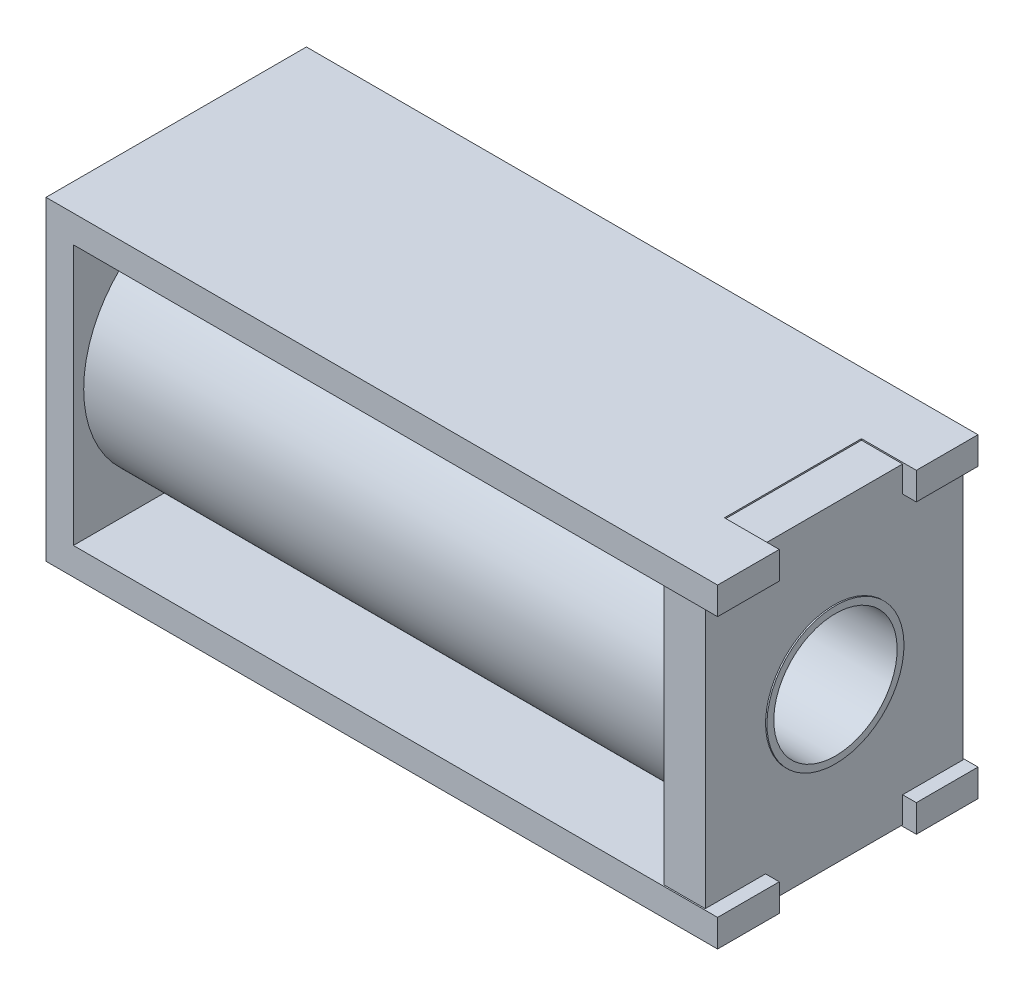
ISO-10303-21;
HEADER;
FILE_DESCRIPTION(('STEP AP214'),'2;1');
FILE_NAME('part.step','',(''),(''),'','','');
FILE_SCHEMA(('AUTOMOTIVE_DESIGN { 1 0 10303 214 1 1 1 1 }'));
ENDSEC;
DATA;
#1=APPLICATION_CONTEXT('core data for automotive mechanical design processes');
#2=APPLICATION_PROTOCOL_DEFINITION('international standard','automotive_design',2000,#1);
#3=PRODUCT_CONTEXT('',#1,'mechanical');
#4=PRODUCT('Part','Part','',(#3));
#5=PRODUCT_RELATED_PRODUCT_CATEGORY('part','',(#4));
#6=PRODUCT_DEFINITION_FORMATION('','',#4);
#7=PRODUCT_DEFINITION_CONTEXT('part definition',#1,'design');
#8=PRODUCT_DEFINITION('design','',#6,#7);
#9=PRODUCT_DEFINITION_SHAPE('','',#8);
#10=(LENGTH_UNIT() NAMED_UNIT(*) SI_UNIT(.MILLI.,.METRE.));
#11=(NAMED_UNIT(*) PLANE_ANGLE_UNIT() SI_UNIT($,.RADIAN.));
#12=(NAMED_UNIT(*) SI_UNIT($,.STERADIAN.) SOLID_ANGLE_UNIT());
#13=UNCERTAINTY_MEASURE_WITH_UNIT(LENGTH_MEASURE(1.E-05),#10,'distance_accuracy_value','');
#14=(GEOMETRIC_REPRESENTATION_CONTEXT(3) GLOBAL_UNCERTAINTY_ASSIGNED_CONTEXT((#13)) GLOBAL_UNIT_ASSIGNED_CONTEXT((#10,
#11,#12)) REPRESENTATION_CONTEXT('',''));
#15=CARTESIAN_POINT('',(0.,0.,0.));
#16=DIRECTION('',(0.,0.,1.));
#17=DIRECTION('',(1.,0.,0.));
#18=AXIS2_PLACEMENT_3D('',#15,#16,#17);
#19=CARTESIAN_POINT('',(49.,9.50000000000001,-9.5));
#20=DIRECTION('',(0.,-1.,0.));
#21=DIRECTION('',(1.,0.,0.));
#22=AXIS2_PLACEMENT_3D('',#19,#20,#21);
#23=PLANE('',#22);
#24=DIRECTION('',(-1.,0.,0.));
#25=VECTOR('',#24,1.);
#26=CARTESIAN_POINT('',(48.,9.5,9.4));
#27=LINE('',#26,#25);
#28=CARTESIAN_POINT('',(48.,9.5,9.4));
#29=VERTEX_POINT('',#28);
#30=CARTESIAN_POINT('',(45.,9.5,9.4));
#31=VERTEX_POINT('',#30);
#32=EDGE_CURVE('E205',#29,#31,#27,.T.);
#33=ORIENTED_EDGE('',*,*,#32,.F.);
#34=DIRECTION('',(0.,0.,1.));
#35=VECTOR('',#34,1.);
#36=CARTESIAN_POINT('',(48.,9.5,9.4));
#37=LINE('',#36,#35);
#38=CARTESIAN_POINT('',(48.,9.50000000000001,5.));
#39=VERTEX_POINT('',#38);
#40=EDGE_CURVE('E210',#39,#29,#37,.T.);
#41=ORIENTED_EDGE('',*,*,#40,.F.);
#42=DIRECTION('',(1.,0.,0.));
#43=VECTOR('',#42,1.);
#44=CARTESIAN_POINT('',(45.,9.5,5.));
#45=LINE('',#44,#43);
#46=CARTESIAN_POINT('',(49.,9.5,5.));
#47=VERTEX_POINT('',#46);
#48=EDGE_CURVE('E268',#39,#47,#45,.T.);
#49=ORIENTED_EDGE('',*,*,#48,.T.);
#50=DIRECTION('',(0.,0.,1.));
#51=VECTOR('',#50,1.);
#52=CARTESIAN_POINT('',(49.,9.50000000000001,-9.5));
#53=LINE('',#52,#51);
#54=CARTESIAN_POINT('',(49.,9.50000000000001,9.5));
#55=VERTEX_POINT('',#54);
#56=EDGE_CURVE('E327',#47,#55,#53,.T.);
#57=ORIENTED_EDGE('',*,*,#56,.T.);
#58=DIRECTION('',(1.,0.,0.));
#59=VECTOR('',#58,1.);
#60=CARTESIAN_POINT('',(49.,9.50000000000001,9.5));
#61=LINE('',#60,#59);
#62=CARTESIAN_POINT('',(2.,9.5,9.5));
#63=VERTEX_POINT('',#62);
#64=EDGE_CURVE('E294',#63,#55,#61,.T.);
#65=ORIENTED_EDGE('',*,*,#64,.F.);
#66=DIRECTION('',(0.,0.,1.));
#67=VECTOR('',#66,1.);
#68=CARTESIAN_POINT('',(2.,9.5,-9.5));
#69=LINE('',#68,#67);
#70=CARTESIAN_POINT('',(2.,9.5,-9.5));
#71=VERTEX_POINT('',#70);
#72=EDGE_CURVE('E328',#71,#63,#69,.T.);
#73=ORIENTED_EDGE('',*,*,#72,.F.);
#74=DIRECTION('',(1.,0.,0.));
#75=VECTOR('',#74,1.);
#76=CARTESIAN_POINT('',(49.,9.50000000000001,-9.5));
#77=LINE('',#76,#75);
#78=CARTESIAN_POINT('',(49.,9.50000000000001,-9.5));
#79=VERTEX_POINT('',#78);
#80=EDGE_CURVE('E318',#71,#79,#77,.T.);
#81=ORIENTED_EDGE('',*,*,#80,.T.);
#82=CARTESIAN_POINT('',(49.,9.5,-5.));
#83=VERTEX_POINT('',#82);
#84=EDGE_CURVE('E324',#79,#83,#53,.T.);
#85=ORIENTED_EDGE('',*,*,#84,.T.);
#86=DIRECTION('',(1.,0.,0.));
#87=VECTOR('',#86,1.);
#88=CARTESIAN_POINT('',(45.,9.5,-5.));
#89=LINE('',#88,#87);
#90=CARTESIAN_POINT('',(48.,9.5,-5.));
#91=VERTEX_POINT('',#90);
#92=EDGE_CURVE('E265',#91,#83,#89,.T.);
#93=ORIENTED_EDGE('',*,*,#92,.F.);
#94=DIRECTION('',(0.,0.,1.));
#95=VECTOR('',#94,1.);
#96=CARTESIAN_POINT('',(48.,9.5,-5.));
#97=LINE('',#96,#95);
#98=CARTESIAN_POINT('',(48.,9.5,-9.4));
#99=VERTEX_POINT('',#98);
#100=EDGE_CURVE('E446',#99,#91,#97,.T.);
#101=ORIENTED_EDGE('',*,*,#100,.F.);
#102=DIRECTION('',(-1.,0.,0.));
#103=VECTOR('',#102,1.);
#104=CARTESIAN_POINT('',(48.,9.5,-9.4));
#105=LINE('',#104,#103);
#106=CARTESIAN_POINT('',(45.,9.5,-9.4));
#107=VERTEX_POINT('',#106);
#108=EDGE_CURVE('E417',#99,#107,#105,.T.);
#109=ORIENTED_EDGE('',*,*,#108,.T.);
#110=DIRECTION('',(0.,0.,-1.));
#111=VECTOR('',#110,1.);
#112=CARTESIAN_POINT('',(45.,9.5,5.));
#113=LINE('',#112,#111);
#114=EDGE_CURVE('E221',#31,#107,#113,.T.);
#115=ORIENTED_EDGE('',*,*,#114,.F.);
#116=EDGE_LOOP('',(#33,#41,#49,#57,#65,#73,#81,#85,#93,#101,#109,#115));
#117=FACE_BOUND('',#116,.T.);
#118=ADVANCED_FACE('F38',(#117),#23,.T.);
#119=CARTESIAN_POINT('',(49.,-9.50000000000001,-9.5));
#120=DIRECTION('',(0.,1.,0.));
#121=DIRECTION('',(-1.,0.,0.));
#122=AXIS2_PLACEMENT_3D('',#119,#120,#121);
#123=PLANE('',#122);
#124=DIRECTION('',(-1.,0.,0.));
#125=VECTOR('',#124,1.);
#126=CARTESIAN_POINT('',(48.,-9.5,-9.4));
#127=LINE('',#126,#125);
#128=CARTESIAN_POINT('',(48.,-9.50000000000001,-9.4));
#129=VERTEX_POINT('',#128);
#130=CARTESIAN_POINT('',(45.,-9.50000000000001,-9.4));
#131=VERTEX_POINT('',#130);
#132=EDGE_CURVE('E55',#129,#131,#127,.T.);
#133=ORIENTED_EDGE('',*,*,#132,.F.);
#134=DIRECTION('',(0.,0.,-1.));
#135=VECTOR('',#134,1.);
#136=CARTESIAN_POINT('',(48.,-9.5,-5.));
#137=LINE('',#136,#135);
#138=CARTESIAN_POINT('',(48.,-9.5,-5.));
#139=VERTEX_POINT('',#138);
#140=EDGE_CURVE('E442',#139,#129,#137,.T.);
#141=ORIENTED_EDGE('',*,*,#140,.F.);
#142=DIRECTION('',(1.,0.,0.));
#143=VECTOR('',#142,1.);
#144=CARTESIAN_POINT('',(45.,-9.5,-5.));
#145=LINE('',#144,#143);
#146=CARTESIAN_POINT('',(49.,-9.5,-5.));
#147=VERTEX_POINT('',#146);
#148=EDGE_CURVE('E245',#139,#147,#145,.T.);
#149=ORIENTED_EDGE('',*,*,#148,.T.);
#150=DIRECTION('',(0.,0.,1.));
#151=VECTOR('',#150,1.);
#152=CARTESIAN_POINT('',(49.,-9.50000000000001,-9.5));
#153=LINE('',#152,#151);
#154=CARTESIAN_POINT('',(49.,-9.50000000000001,-9.5));
#155=VERTEX_POINT('',#154);
#156=EDGE_CURVE('E332',#155,#147,#153,.T.);
#157=ORIENTED_EDGE('',*,*,#156,.F.);
#158=DIRECTION('',(-1.,0.,0.));
#159=VECTOR('',#158,1.);
#160=CARTESIAN_POINT('',(49.,-9.50000000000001,-9.5));
#161=LINE('',#160,#159);
#162=CARTESIAN_POINT('',(2.,-9.5,-9.5));
#163=VERTEX_POINT('',#162);
#164=EDGE_CURVE('E312',#155,#163,#161,.T.);
#165=ORIENTED_EDGE('',*,*,#164,.T.);
#166=DIRECTION('',(0.,0.,1.));
#167=VECTOR('',#166,1.);
#168=CARTESIAN_POINT('',(2.,-9.5,-9.5));
#169=LINE('',#168,#167);
#170=CARTESIAN_POINT('',(2.,-9.5,9.5));
#171=VERTEX_POINT('',#170);
#172=EDGE_CURVE('E330',#163,#171,#169,.T.);
#173=ORIENTED_EDGE('',*,*,#172,.T.);
#174=DIRECTION('',(-1.,0.,0.));
#175=VECTOR('',#174,1.);
#176=CARTESIAN_POINT('',(49.,-9.50000000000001,9.5));
#177=LINE('',#176,#175);
#178=CARTESIAN_POINT('',(49.,-9.50000000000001,9.5));
#179=VERTEX_POINT('',#178);
#180=EDGE_CURVE('E288',#179,#171,#177,.T.);
#181=ORIENTED_EDGE('',*,*,#180,.F.);
#182=CARTESIAN_POINT('',(49.,-9.5,5.));
#183=VERTEX_POINT('',#182);
#184=EDGE_CURVE('E335',#183,#179,#153,.T.);
#185=ORIENTED_EDGE('',*,*,#184,.F.);
#186=DIRECTION('',(1.,0.,0.));
#187=VECTOR('',#186,1.);
#188=CARTESIAN_POINT('',(45.,-9.5,5.));
#189=LINE('',#188,#187);
#190=CARTESIAN_POINT('',(48.,-9.5,5.));
#191=VERTEX_POINT('',#190);
#192=EDGE_CURVE('E242',#191,#183,#189,.T.);
#193=ORIENTED_EDGE('',*,*,#192,.F.);
#194=DIRECTION('',(0.,0.,-1.));
#195=VECTOR('',#194,1.);
#196=CARTESIAN_POINT('',(48.,-9.5,9.4));
#197=LINE('',#196,#195);
#198=CARTESIAN_POINT('',(48.,-9.50000000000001,9.4));
#199=VERTEX_POINT('',#198);
#200=EDGE_CURVE('E209',#199,#191,#197,.T.);
#201=ORIENTED_EDGE('',*,*,#200,.F.);
#202=DIRECTION('',(-1.,0.,0.));
#203=VECTOR('',#202,1.);
#204=CARTESIAN_POINT('',(48.,-9.5,9.4));
#205=LINE('',#204,#203);
#206=CARTESIAN_POINT('',(45.,-9.50000000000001,9.4));
#207=VERTEX_POINT('',#206);
#208=EDGE_CURVE('E206',#199,#207,#205,.T.);
#209=ORIENTED_EDGE('',*,*,#208,.T.);
#210=DIRECTION('',(0.,0.,1.));
#211=VECTOR('',#210,1.);
#212=CARTESIAN_POINT('',(45.,-9.5,5.));
#213=LINE('',#212,#211);
#214=EDGE_CURVE('E60',#131,#207,#213,.T.);
#215=ORIENTED_EDGE('',*,*,#214,.F.);
#216=EDGE_LOOP('',(#133,#141,#149,#157,#165,#173,#181,#185,#193,#201,#209,#215));
#217=FACE_BOUND('',#216,.T.);
#218=ADVANCED_FACE('F394',(#217),#123,.T.);
#219=CARTESIAN_POINT('',(45.,11.5,-5.));
#220=DIRECTION('',(0.,0.,-1.));
#221=DIRECTION('',(-1.,0.,0.));
#222=AXIS2_PLACEMENT_3D('',#219,#220,#221);
#223=PLANE('',#222);
#224=DIRECTION('',(-1.,0.,0.));
#225=VECTOR('',#224,1.);
#226=CARTESIAN_POINT('',(48.,11.4,-5.));
#227=LINE('',#226,#225);
#228=CARTESIAN_POINT('',(48.,11.4,-5.));
#229=VERTEX_POINT('',#228);
#230=CARTESIAN_POINT('',(45.,11.4,-5.));
#231=VERTEX_POINT('',#230);
#232=EDGE_CURVE('E400',#229,#231,#227,.T.);
#233=ORIENTED_EDGE('',*,*,#232,.F.);
#234=DIRECTION('',(0.,1.,0.));
#235=VECTOR('',#234,1.);
#236=CARTESIAN_POINT('',(48.,9.5,-5.));
#237=LINE('',#236,#235);
#238=EDGE_CURVE('E402',#91,#229,#237,.T.);
#239=ORIENTED_EDGE('',*,*,#238,.F.);
#240=ORIENTED_EDGE('',*,*,#92,.T.);
#241=DIRECTION('',(0.,1.,0.));
#242=VECTOR('',#241,1.);
#243=CARTESIAN_POINT('',(49.,11.5,-5.));
#244=LINE('',#243,#242);
#245=CARTESIAN_POINT('',(49.,11.5,-5.));
#246=VERTEX_POINT('',#245);
#247=EDGE_CURVE('E244',#83,#246,#244,.T.);
#248=ORIENTED_EDGE('',*,*,#247,.T.);
#249=DIRECTION('',(1.,0.,0.));
#250=VECTOR('',#249,1.);
#251=CARTESIAN_POINT('',(45.,11.5,-5.));
#252=LINE('',#251,#250);
#253=CARTESIAN_POINT('',(45.,11.5,-5.));
#254=VERTEX_POINT('',#253);
#255=EDGE_CURVE('E261',#254,#246,#252,.T.);
#256=ORIENTED_EDGE('',*,*,#255,.F.);
#257=DIRECTION('',(0.,1.,0.));
#258=VECTOR('',#257,1.);
#259=CARTESIAN_POINT('',(45.,11.5,-5.));
#260=LINE('',#259,#258);
#261=EDGE_CURVE('E251',#231,#254,#260,.T.);
#262=ORIENTED_EDGE('',*,*,#261,.F.);
#263=EDGE_LOOP('',(#233,#239,#240,#248,#256,#262));
#264=FACE_BOUND('',#263,.T.);
#265=ADVANCED_FACE('F371',(#264),#223,.F.);
#266=CARTESIAN_POINT('',(45.,11.5,5.));
#267=DIRECTION('',(0.,0.,1.));
#268=DIRECTION('',(1.,0.,0.));
#269=AXIS2_PLACEMENT_3D('',#266,#267,#268);
#270=PLANE('',#269);
#271=DIRECTION('',(-1.,0.,0.));
#272=VECTOR('',#271,1.);
#273=CARTESIAN_POINT('',(48.,11.4,5.));
#274=LINE('',#273,#272);
#275=CARTESIAN_POINT('',(48.,11.4,5.));
#276=VERTEX_POINT('',#275);
#277=CARTESIAN_POINT('',(45.,11.4,5.));
#278=VERTEX_POINT('',#277);
#279=EDGE_CURVE('E363',#276,#278,#274,.T.);
#280=ORIENTED_EDGE('',*,*,#279,.T.);
#281=DIRECTION('',(0.,-1.,0.));
#282=VECTOR('',#281,1.);
#283=CARTESIAN_POINT('',(45.,11.5,5.));
#284=LINE('',#283,#282);
#285=CARTESIAN_POINT('',(45.,11.5,5.));
#286=VERTEX_POINT('',#285);
#287=EDGE_CURVE('E257',#286,#278,#284,.T.);
#288=ORIENTED_EDGE('',*,*,#287,.F.);
#289=DIRECTION('',(1.,0.,0.));
#290=VECTOR('',#289,1.);
#291=CARTESIAN_POINT('',(45.,11.5,5.));
#292=LINE('',#291,#290);
#293=CARTESIAN_POINT('',(49.,11.5,5.));
#294=VERTEX_POINT('',#293);
#295=EDGE_CURVE('E270',#286,#294,#292,.T.);
#296=ORIENTED_EDGE('',*,*,#295,.T.);
#297=DIRECTION('',(0.,-1.,0.));
#298=VECTOR('',#297,1.);
#299=CARTESIAN_POINT('',(49.,11.5,5.));
#300=LINE('',#299,#298);
#301=EDGE_CURVE('E254',#294,#47,#300,.T.);
#302=ORIENTED_EDGE('',*,*,#301,.T.);
#303=ORIENTED_EDGE('',*,*,#48,.F.);
#304=DIRECTION('',(0.,-1.,0.));
#305=VECTOR('',#304,1.);
#306=CARTESIAN_POINT('',(48.,11.4,5.));
#307=LINE('',#306,#305);
#308=EDGE_CURVE('E215',#276,#39,#307,.T.);
#309=ORIENTED_EDGE('',*,*,#308,.F.);
#310=EDGE_LOOP('',(#280,#288,#296,#302,#303,#309));
#311=FACE_BOUND('',#310,.T.);
#312=ADVANCED_FACE('F361',(#311),#270,.F.);
#313=CARTESIAN_POINT('',(45.,0.,0.));
#314=DIRECTION('',(1.,0.,0.));
#315=DIRECTION('',(0.,0.,-1.));
#316=AXIS2_PLACEMENT_3D('',#313,#314,#315);
#317=PLANE('',#316);
#318=ORIENTED_EDGE('',*,*,#287,.T.);
#319=DIRECTION('',(0.,0.,1.));
#320=VECTOR('',#319,1.);
#321=CARTESIAN_POINT('',(45.,11.4,-5.));
#322=LINE('',#321,#320);
#323=EDGE_CURVE('E218',#231,#278,#322,.T.);
#324=ORIENTED_EDGE('',*,*,#323,.F.);
#325=ORIENTED_EDGE('',*,*,#261,.T.);
#326=DIRECTION('',(0.,0.,1.));
#327=VECTOR('',#326,1.);
#328=CARTESIAN_POINT('',(45.,11.5,5.));
#329=LINE('',#328,#327);
#330=EDGE_CURVE('E253',#254,#286,#329,.T.);
#331=ORIENTED_EDGE('',*,*,#330,.T.);
#332=EDGE_LOOP('',(#318,#324,#325,#331));
#333=FACE_BOUND('',#332,.T.);
#334=ADVANCED_FACE('F366',(#333),#317,.T.);
#335=CARTESIAN_POINT('',(45.,-11.5,5.));
#336=DIRECTION('',(0.,0.,1.));
#337=DIRECTION('',(1.,0.,0.));
#338=AXIS2_PLACEMENT_3D('',#335,#336,#337);
#339=PLANE('',#338);
#340=DIRECTION('',(-1.,0.,0.));
#341=VECTOR('',#340,1.);
#342=CARTESIAN_POINT('',(48.,-11.4,5.));
#343=LINE('',#342,#341);
#344=CARTESIAN_POINT('',(48.,-11.4,5.));
#345=VERTEX_POINT('',#344);
#346=CARTESIAN_POINT('',(45.,-11.4,5.));
#347=VERTEX_POINT('',#346);
#348=EDGE_CURVE('E227',#345,#347,#343,.T.);
#349=ORIENTED_EDGE('',*,*,#348,.F.);
#350=DIRECTION('',(0.,-1.,0.));
#351=VECTOR('',#350,1.);
#352=CARTESIAN_POINT('',(48.,-9.5,5.));
#353=LINE('',#352,#351);
#354=EDGE_CURVE('E433',#191,#345,#353,.T.);
#355=ORIENTED_EDGE('',*,*,#354,.F.);
#356=ORIENTED_EDGE('',*,*,#192,.T.);
#357=DIRECTION('',(0.,-1.,0.));
#358=VECTOR('',#357,1.);
#359=CARTESIAN_POINT('',(49.,-11.5,5.));
#360=LINE('',#359,#358);
#361=CARTESIAN_POINT('',(49.,-11.5,5.));
#362=VERTEX_POINT('',#361);
#363=EDGE_CURVE('E223',#183,#362,#360,.T.);
#364=ORIENTED_EDGE('',*,*,#363,.T.);
#365=DIRECTION('',(1.,0.,0.));
#366=VECTOR('',#365,1.);
#367=CARTESIAN_POINT('',(45.,-11.5,5.));
#368=LINE('',#367,#366);
#369=CARTESIAN_POINT('',(45.,-11.5,5.));
#370=VERTEX_POINT('',#369);
#371=EDGE_CURVE('E238',#370,#362,#368,.T.);
#372=ORIENTED_EDGE('',*,*,#371,.F.);
#373=DIRECTION('',(0.,-1.,0.));
#374=VECTOR('',#373,1.);
#375=CARTESIAN_POINT('',(45.,-11.5,5.));
#376=LINE('',#375,#374);
#377=EDGE_CURVE('E231',#347,#370,#376,.T.);
#378=ORIENTED_EDGE('',*,*,#377,.F.);
#379=EDGE_LOOP('',(#349,#355,#356,#364,#372,#378));
#380=FACE_BOUND('',#379,.T.);
#381=ADVANCED_FACE('F432',(#380),#339,.F.);
#382=CARTESIAN_POINT('',(45.,-11.5,-5.));
#383=DIRECTION('',(0.,0.,-1.));
#384=DIRECTION('',(-1.,0.,0.));
#385=AXIS2_PLACEMENT_3D('',#382,#383,#384);
#386=PLANE('',#385);
#387=DIRECTION('',(-1.,0.,0.));
#388=VECTOR('',#387,1.);
#389=CARTESIAN_POINT('',(48.,-11.4,-5.));
#390=LINE('',#389,#388);
#391=CARTESIAN_POINT('',(48.,-11.4,-5.));
#392=VERTEX_POINT('',#391);
#393=CARTESIAN_POINT('',(45.,-11.4,-5.));
#394=VERTEX_POINT('',#393);
#395=EDGE_CURVE('E420',#392,#394,#390,.T.);
#396=ORIENTED_EDGE('',*,*,#395,.T.);
#397=DIRECTION('',(0.,1.,0.));
#398=VECTOR('',#397,1.);
#399=CARTESIAN_POINT('',(45.,-11.5,-5.));
#400=LINE('',#399,#398);
#401=CARTESIAN_POINT('',(45.,-11.5,-5.));
#402=VERTEX_POINT('',#401);
#403=EDGE_CURVE('E236',#402,#394,#400,.T.);
#404=ORIENTED_EDGE('',*,*,#403,.F.);
#405=DIRECTION('',(1.,0.,0.));
#406=VECTOR('',#405,1.);
#407=CARTESIAN_POINT('',(45.,-11.5,-5.));
#408=LINE('',#407,#406);
#409=CARTESIAN_POINT('',(49.,-11.5,-5.));
#410=VERTEX_POINT('',#409);
#411=EDGE_CURVE('E247',#402,#410,#408,.T.);
#412=ORIENTED_EDGE('',*,*,#411,.T.);
#413=DIRECTION('',(0.,1.,0.));
#414=VECTOR('',#413,1.);
#415=CARTESIAN_POINT('',(49.,-11.5,-5.));
#416=LINE('',#415,#414);
#417=EDGE_CURVE('E225',#410,#147,#416,.T.);
#418=ORIENTED_EDGE('',*,*,#417,.T.);
#419=ORIENTED_EDGE('',*,*,#148,.F.);
#420=DIRECTION('',(0.,1.,0.));
#421=VECTOR('',#420,1.);
#422=CARTESIAN_POINT('',(48.,-11.4,-5.));
#423=LINE('',#422,#421);
#424=EDGE_CURVE('E437',#392,#139,#423,.T.);
#425=ORIENTED_EDGE('',*,*,#424,.F.);
#426=EDGE_LOOP('',(#396,#404,#412,#418,#419,#425));
#427=FACE_BOUND('',#426,.T.);
#428=ADVANCED_FACE('F566',(#427),#386,.F.);
#429=CARTESIAN_POINT('',(45.,0.,0.));
#430=DIRECTION('',(-1.,0.,0.));
#431=DIRECTION('',(0.,0.,1.));
#432=AXIS2_PLACEMENT_3D('',#429,#430,#431);
#433=PLANE('',#432);
#434=DIRECTION('',(0.,0.,-1.));
#435=VECTOR('',#434,1.);
#436=CARTESIAN_POINT('',(45.,-11.4,5.));
#437=LINE('',#436,#435);
#438=EDGE_CURVE('E408',#347,#394,#437,.T.);
#439=ORIENTED_EDGE('',*,*,#438,.F.);
#440=ORIENTED_EDGE('',*,*,#377,.T.);
#441=DIRECTION('',(0.,0.,-1.));
#442=VECTOR('',#441,1.);
#443=CARTESIAN_POINT('',(45.,-11.5,5.));
#444=LINE('',#443,#442);
#445=EDGE_CURVE('E233',#370,#402,#444,.T.);
#446=ORIENTED_EDGE('',*,*,#445,.T.);
#447=ORIENTED_EDGE('',*,*,#403,.T.);
#448=EDGE_LOOP('',(#439,#440,#446,#447));
#449=FACE_BOUND('',#448,.T.);
#450=ADVANCED_FACE('F570',(#449),#433,.F.);
#451=CARTESIAN_POINT('',(49.,-11.5,-9.5));
#452=DIRECTION('',(1.,0.,0.));
#453=DIRECTION('',(0.,0.,-1.));
#454=AXIS2_PLACEMENT_3D('',#451,#452,#453);
#455=PLANE('',#454);
#456=ORIENTED_EDGE('',*,*,#363,.F.);
#457=ORIENTED_EDGE('',*,*,#184,.T.);
#458=DIRECTION('',(0.,1.,0.));
#459=VECTOR('',#458,1.);
#460=CARTESIAN_POINT('',(49.,-11.5,9.5));
#461=LINE('',#460,#459);
#462=CARTESIAN_POINT('',(49.,-11.5,9.5));
#463=VERTEX_POINT('',#462);
#464=EDGE_CURVE('E285',#463,#179,#461,.T.);
#465=ORIENTED_EDGE('',*,*,#464,.F.);
#466=DIRECTION('',(0.,0.,1.));
#467=VECTOR('',#466,1.);
#468=CARTESIAN_POINT('',(49.,-11.5,-9.5));
#469=LINE('',#468,#467);
#470=EDGE_CURVE('E338',#362,#463,#469,.T.);
#471=ORIENTED_EDGE('',*,*,#470,.F.);
#472=EDGE_LOOP('',(#456,#457,#465,#471));
#473=FACE_BOUND('',#472,.T.);
#474=ADVANCED_FACE('F391',(#473),#455,.T.);
#475=CARTESIAN_POINT('',(49.,11.5,-9.5));
#476=DIRECTION('',(1.,0.,0.));
#477=DIRECTION('',(0.,0.,-1.));
#478=AXIS2_PLACEMENT_3D('',#475,#476,#477);
#479=PLANE('',#478);
#480=ORIENTED_EDGE('',*,*,#247,.F.);
#481=ORIENTED_EDGE('',*,*,#84,.F.);
#482=DIRECTION('',(0.,1.,0.));
#483=VECTOR('',#482,1.);
#484=CARTESIAN_POINT('',(49.,11.5,-9.5));
#485=LINE('',#484,#483);
#486=CARTESIAN_POINT('',(49.,11.5,-9.5));
#487=VERTEX_POINT('',#486);
#488=EDGE_CURVE('E321',#79,#487,#485,.T.);
#489=ORIENTED_EDGE('',*,*,#488,.T.);
#490=DIRECTION('',(0.,0.,1.));
#491=VECTOR('',#490,1.);
#492=CARTESIAN_POINT('',(49.,11.5,-9.5));
#493=LINE('',#492,#491);
#494=EDGE_CURVE('E12',#487,#246,#493,.T.);
#495=ORIENTED_EDGE('',*,*,#494,.T.);
#496=EDGE_LOOP('',(#480,#481,#489,#495));
#497=FACE_BOUND('',#496,.T.);
#498=ADVANCED_FACE('F374',(#497),#479,.T.);
#499=CARTESIAN_POINT('',(0.,11.5,-9.5));
#500=DIRECTION('',(0.,1.,0.));
#501=DIRECTION('',(0.,0.,1.));
#502=AXIS2_PLACEMENT_3D('',#499,#500,#501);
#503=PLANE('',#502);
#504=ORIENTED_EDGE('',*,*,#255,.T.);
#505=ORIENTED_EDGE('',*,*,#494,.F.);
#506=DIRECTION('',(-1.,0.,0.));
#507=VECTOR('',#506,1.);
#508=CARTESIAN_POINT('',(0.,11.5,-9.5));
#509=LINE('',#508,#507);
#510=CARTESIAN_POINT('',(0.,11.5,-9.5));
#511=VERTEX_POINT('',#510);
#512=EDGE_CURVE('E300',#487,#511,#509,.T.);
#513=ORIENTED_EDGE('',*,*,#512,.T.);
#514=DIRECTION('',(0.,0.,1.));
#515=VECTOR('',#514,1.);
#516=CARTESIAN_POINT('',(0.,11.5,-9.5));
#517=LINE('',#516,#515);
#518=CARTESIAN_POINT('',(0.,11.5,9.5));
#519=VERTEX_POINT('',#518);
#520=EDGE_CURVE('E42',#511,#519,#517,.T.);
#521=ORIENTED_EDGE('',*,*,#520,.T.);
#522=DIRECTION('',(-1.,0.,0.));
#523=VECTOR('',#522,1.);
#524=CARTESIAN_POINT('',(0.,11.5,9.5));
#525=LINE('',#524,#523);
#526=CARTESIAN_POINT('',(49.,11.5,9.5));
#527=VERTEX_POINT('',#526);
#528=EDGE_CURVE('E276',#527,#519,#525,.T.);
#529=ORIENTED_EDGE('',*,*,#528,.F.);
#530=EDGE_CURVE('E47',#294,#527,#493,.T.);
#531=ORIENTED_EDGE('',*,*,#530,.F.);
#532=ORIENTED_EDGE('',*,*,#295,.F.);
#533=ORIENTED_EDGE('',*,*,#330,.F.);
#534=EDGE_LOOP('',(#504,#505,#513,#521,#529,#531,#532,#533));
#535=FACE_BOUND('',#534,.T.);
#536=ADVANCED_FACE('F40',(#535),#503,.T.);
#537=ORIENTED_EDGE('',*,*,#301,.F.);
#538=ORIENTED_EDGE('',*,*,#530,.T.);
#539=DIRECTION('',(0.,1.,0.));
#540=VECTOR('',#539,1.);
#541=CARTESIAN_POINT('',(49.,11.5,9.5));
#542=LINE('',#541,#540);
#543=EDGE_CURVE('E297',#55,#527,#542,.T.);
#544=ORIENTED_EDGE('',*,*,#543,.F.);
#545=ORIENTED_EDGE('',*,*,#56,.F.);
#546=EDGE_LOOP('',(#537,#538,#544,#545));
#547=FACE_BOUND('',#546,.T.);
#548=ADVANCED_FACE('F356',(#547),#479,.T.);
#549=CARTESIAN_POINT('',(2.,9.5,-9.5));
#550=DIRECTION('',(1.,0.,0.));
#551=DIRECTION('',(0.,0.,-1.));
#552=AXIS2_PLACEMENT_3D('',#549,#550,#551);
#553=PLANE('',#552);
#554=CARTESIAN_POINT('',(2.00000000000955,0.,0.));
#555=DIRECTION('',(1.,0.,0.));
#556=DIRECTION('',(0.,0.,-1.));
#557=AXIS2_PLACEMENT_3D('',#554,#555,#556);
#558=CIRCLE('',#557,8.75);
#559=CARTESIAN_POINT('',(2.00000000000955,0.,-8.75));
#560=VERTEX_POINT('',#559);
#561=EDGE_CURVE('E780',#560,#560,#558,.T.);
#562=ORIENTED_EDGE('',*,*,#561,.F.);
#563=EDGE_LOOP('',(#562));
#564=FACE_BOUND('',#563,.T.);
#565=ORIENTED_EDGE('',*,*,#72,.T.);
#566=DIRECTION('',(0.,1.,0.));
#567=VECTOR('',#566,1.);
#568=CARTESIAN_POINT('',(2.,9.5,9.5));
#569=LINE('',#568,#567);
#570=EDGE_CURVE('E291',#171,#63,#569,.T.);
#571=ORIENTED_EDGE('',*,*,#570,.F.);
#572=ORIENTED_EDGE('',*,*,#172,.F.);
#573=DIRECTION('',(0.,1.,0.));
#574=VECTOR('',#573,1.);
#575=CARTESIAN_POINT('',(2.,9.5,-9.5));
#576=LINE('',#575,#574);
#577=EDGE_CURVE('E315',#163,#71,#576,.T.);
#578=ORIENTED_EDGE('',*,*,#577,.T.);
#579=EDGE_LOOP('',(#565,#571,#572,#578));
#580=FACE_BOUND('',#579,.T.);
#581=ADVANCED_FACE('F397',(#564,#580),#553,.T.);
#582=ORIENTED_EDGE('',*,*,#417,.F.);
#583=CARTESIAN_POINT('',(49.,-11.5,-9.5));
#584=VERTEX_POINT('',#583);
#585=EDGE_CURVE('E336',#584,#410,#469,.T.);
#586=ORIENTED_EDGE('',*,*,#585,.F.);
#587=DIRECTION('',(0.,1.,0.));
#588=VECTOR('',#587,1.);
#589=CARTESIAN_POINT('',(49.,-11.5,-9.5));
#590=LINE('',#589,#588);
#591=EDGE_CURVE('E309',#584,#155,#590,.T.);
#592=ORIENTED_EDGE('',*,*,#591,.T.);
#593=ORIENTED_EDGE('',*,*,#156,.T.);
#594=EDGE_LOOP('',(#582,#586,#592,#593));
#595=FACE_BOUND('',#594,.T.);
#596=ADVANCED_FACE('F477',(#595),#455,.T.);
#597=CARTESIAN_POINT('',(0.,-11.5,-9.5));
#598=DIRECTION('',(0.,-1.,0.));
#599=DIRECTION('',(0.,0.,-1.));
#600=AXIS2_PLACEMENT_3D('',#597,#598,#599);
#601=PLANE('',#600);
#602=ORIENTED_EDGE('',*,*,#371,.T.);
#603=ORIENTED_EDGE('',*,*,#470,.T.);
#604=DIRECTION('',(1.,0.,0.));
#605=VECTOR('',#604,1.);
#606=CARTESIAN_POINT('',(0.,-11.5,9.5));
#607=LINE('',#606,#605);
#608=CARTESIAN_POINT('',(0.,-11.5,9.5));
#609=VERTEX_POINT('',#608);
#610=EDGE_CURVE('E282',#609,#463,#607,.T.);
#611=ORIENTED_EDGE('',*,*,#610,.F.);
#612=DIRECTION('',(0.,0.,1.));
#613=VECTOR('',#612,1.);
#614=CARTESIAN_POINT('',(0.,-11.5,-9.5));
#615=LINE('',#614,#613);
#616=CARTESIAN_POINT('',(0.,-11.5,-9.5));
#617=VERTEX_POINT('',#616);
#618=EDGE_CURVE('E339',#617,#609,#615,.T.);
#619=ORIENTED_EDGE('',*,*,#618,.F.);
#620=DIRECTION('',(1.,0.,0.));
#621=VECTOR('',#620,1.);
#622=CARTESIAN_POINT('',(0.,-11.5,-9.5));
#623=LINE('',#622,#621);
#624=EDGE_CURVE('E306',#617,#584,#623,.T.);
#625=ORIENTED_EDGE('',*,*,#624,.T.);
#626=ORIENTED_EDGE('',*,*,#585,.T.);
#627=ORIENTED_EDGE('',*,*,#411,.F.);
#628=ORIENTED_EDGE('',*,*,#445,.F.);
#629=EDGE_LOOP('',(#602,#603,#611,#619,#625,#626,#627,#628));
#630=FACE_BOUND('',#629,.T.);
#631=ADVANCED_FACE('F384',(#630),#601,.T.);
#632=CARTESIAN_POINT('',(0.,-11.5,-9.5));
#633=DIRECTION('',(-1.,0.,0.));
#634=DIRECTION('',(0.,0.,1.));
#635=AXIS2_PLACEMENT_3D('',#632,#633,#634);
#636=PLANE('',#635);
#637=CARTESIAN_POINT('',(0.,0.,0.));
#638=DIRECTION('',(-1.,0.,0.));
#639=DIRECTION('',(0.,0.,1.));
#640=AXIS2_PLACEMENT_3D('',#637,#638,#639);
#641=CIRCLE('',#640,2.5);
#642=CARTESIAN_POINT('',(0.,0.,2.5));
#643=VERTEX_POINT('',#642);
#644=EDGE_CURVE('E267',#643,#643,#641,.T.);
#645=ORIENTED_EDGE('',*,*,#644,.F.);
#646=EDGE_LOOP('',(#645));
#647=FACE_BOUND('',#646,.T.);
#648=ORIENTED_EDGE('',*,*,#618,.T.);
#649=DIRECTION('',(0.,-1.,0.));
#650=VECTOR('',#649,1.);
#651=CARTESIAN_POINT('',(0.,-11.5,9.5));
#652=LINE('',#651,#650);
#653=EDGE_CURVE('E279',#519,#609,#652,.T.);
#654=ORIENTED_EDGE('',*,*,#653,.F.);
#655=ORIENTED_EDGE('',*,*,#520,.F.);
#656=DIRECTION('',(0.,-1.,0.));
#657=VECTOR('',#656,1.);
#658=CARTESIAN_POINT('',(0.,-11.5,-9.5));
#659=LINE('',#658,#657);
#660=EDGE_CURVE('E303',#511,#617,#659,.T.);
#661=ORIENTED_EDGE('',*,*,#660,.T.);
#662=EDGE_LOOP('',(#648,#654,#655,#661));
#663=FACE_BOUND('',#662,.T.);
#664=ADVANCED_FACE('F347',(#647,#663),#636,.T.);
#665=CARTESIAN_POINT('',(0.,0.,-9.5));
#666=DIRECTION('',(0.,0.,-1.));
#667=DIRECTION('',(-1.,0.,0.));
#668=AXIS2_PLACEMENT_3D('',#665,#666,#667);
#669=PLANE('',#668);
#670=ORIENTED_EDGE('',*,*,#512,.F.);
#671=ORIENTED_EDGE('',*,*,#488,.F.);
#672=ORIENTED_EDGE('',*,*,#80,.F.);
#673=ORIENTED_EDGE('',*,*,#577,.F.);
#674=ORIENTED_EDGE('',*,*,#164,.F.);
#675=ORIENTED_EDGE('',*,*,#591,.F.);
#676=ORIENTED_EDGE('',*,*,#624,.F.);
#677=ORIENTED_EDGE('',*,*,#660,.F.);
#678=EDGE_LOOP('',(#670,#671,#672,#673,#674,#675,#676,#677));
#679=FACE_BOUND('',#678,.T.);
#680=ADVANCED_FACE('F378',(#679),#669,.T.);
#681=CARTESIAN_POINT('',(0.,0.,9.5));
#682=DIRECTION('',(0.,0.,-1.));
#683=DIRECTION('',(-1.,0.,0.));
#684=AXIS2_PLACEMENT_3D('',#681,#682,#683);
#685=PLANE('',#684);
#686=ORIENTED_EDGE('',*,*,#528,.T.);
#687=ORIENTED_EDGE('',*,*,#653,.T.);
#688=ORIENTED_EDGE('',*,*,#610,.T.);
#689=ORIENTED_EDGE('',*,*,#464,.T.);
#690=ORIENTED_EDGE('',*,*,#180,.T.);
#691=ORIENTED_EDGE('',*,*,#570,.T.);
#692=ORIENTED_EDGE('',*,*,#64,.T.);
#693=ORIENTED_EDGE('',*,*,#543,.T.);
#694=EDGE_LOOP('',(#686,#687,#688,#689,#690,#691,#692,#693));
#695=FACE_BOUND('',#694,.T.);
#696=ADVANCED_FACE('F350',(#695),#685,.F.);
#697=CARTESIAN_POINT('',(48.,-9.5,9.4));
#698=DIRECTION('',(0.,0.,-1.));
#699=DIRECTION('',(-1.,0.,0.));
#700=AXIS2_PLACEMENT_3D('',#697,#698,#699);
#701=PLANE('',#700);
#702=DIRECTION('',(0.,-1.,0.));
#703=VECTOR('',#702,1.);
#704=CARTESIAN_POINT('',(45.,-9.5,9.4));
#705=LINE('',#704,#703);
#706=EDGE_CURVE('E406',#31,#207,#705,.T.);
#707=ORIENTED_EDGE('',*,*,#706,.T.);
#708=ORIENTED_EDGE('',*,*,#208,.F.);
#709=DIRECTION('',(0.,-1.,0.));
#710=VECTOR('',#709,1.);
#711=CARTESIAN_POINT('',(48.,-9.5,9.4));
#712=LINE('',#711,#710);
#713=EDGE_CURVE('E200',#29,#199,#712,.T.);
#714=ORIENTED_EDGE('',*,*,#713,.F.);
#715=ORIENTED_EDGE('',*,*,#32,.T.);
#716=EDGE_LOOP('',(#707,#708,#714,#715));
#717=FACE_BOUND('',#716,.T.);
#718=ADVANCED_FACE('F203',(#717),#701,.F.);
#719=CARTESIAN_POINT('',(48.,-11.4,5.));
#720=DIRECTION('',(0.,1.,0.));
#721=DIRECTION('',(0.,0.,1.));
#722=AXIS2_PLACEMENT_3D('',#719,#720,#721);
#723=PLANE('',#722);
#724=ORIENTED_EDGE('',*,*,#438,.T.);
#725=ORIENTED_EDGE('',*,*,#395,.F.);
#726=DIRECTION('',(0.,0.,-1.));
#727=VECTOR('',#726,1.);
#728=CARTESIAN_POINT('',(48.,-11.4,5.));
#729=LINE('',#728,#727);
#730=EDGE_CURVE('E428',#345,#392,#729,.T.);
#731=ORIENTED_EDGE('',*,*,#730,.F.);
#732=ORIENTED_EDGE('',*,*,#348,.T.);
#733=EDGE_LOOP('',(#724,#725,#731,#732));
#734=FACE_BOUND('',#733,.T.);
#735=ADVANCED_FACE('F425',(#734),#723,.F.);
#736=CARTESIAN_POINT('',(48.,-9.5,-9.4));
#737=DIRECTION('',(0.,0.,1.));
#738=DIRECTION('',(1.,0.,0.));
#739=AXIS2_PLACEMENT_3D('',#736,#737,#738);
#740=PLANE('',#739);
#741=DIRECTION('',(0.,1.,0.));
#742=VECTOR('',#741,1.);
#743=CARTESIAN_POINT('',(45.,-9.5,-9.4));
#744=LINE('',#743,#742);
#745=EDGE_CURVE('E412',#131,#107,#744,.T.);
#746=ORIENTED_EDGE('',*,*,#745,.T.);
#747=ORIENTED_EDGE('',*,*,#108,.F.);
#748=DIRECTION('',(0.,1.,0.));
#749=VECTOR('',#748,1.);
#750=CARTESIAN_POINT('',(48.,-9.5,-9.4));
#751=LINE('',#750,#749);
#752=EDGE_CURVE('E444',#129,#99,#751,.T.);
#753=ORIENTED_EDGE('',*,*,#752,.F.);
#754=ORIENTED_EDGE('',*,*,#132,.T.);
#755=EDGE_LOOP('',(#746,#747,#753,#754));
#756=FACE_BOUND('',#755,.T.);
#757=ADVANCED_FACE('F454',(#756),#740,.F.);
#758=CARTESIAN_POINT('',(48.,11.4,-5.));
#759=DIRECTION('',(0.,-1.,0.));
#760=DIRECTION('',(0.,0.,-1.));
#761=AXIS2_PLACEMENT_3D('',#758,#759,#760);
#762=PLANE('',#761);
#763=ORIENTED_EDGE('',*,*,#323,.T.);
#764=ORIENTED_EDGE('',*,*,#279,.F.);
#765=DIRECTION('',(0.,0.,1.));
#766=VECTOR('',#765,1.);
#767=CARTESIAN_POINT('',(48.,11.4,-5.));
#768=LINE('',#767,#766);
#769=EDGE_CURVE('E398',#229,#276,#768,.T.);
#770=ORIENTED_EDGE('',*,*,#769,.F.);
#771=ORIENTED_EDGE('',*,*,#232,.T.);
#772=EDGE_LOOP('',(#763,#764,#770,#771));
#773=FACE_BOUND('',#772,.T.);
#774=ADVANCED_FACE('F452',(#773),#762,.F.);
#775=CARTESIAN_POINT('',(48.,0.,0.));
#776=DIRECTION('',(-1.,0.,0.));
#777=DIRECTION('',(0.,0.,1.));
#778=AXIS2_PLACEMENT_3D('',#775,#776,#777);
#779=PLANE('',#778);
#780=CARTESIAN_POINT('',(48.,0.,0.));
#781=DIRECTION('',(1.,0.,0.));
#782=DIRECTION('',(0.,0.,-1.));
#783=AXIS2_PLACEMENT_3D('',#780,#781,#782);
#784=CIRCLE('',#783,5.);
#785=CARTESIAN_POINT('',(48.,0.,-5.));
#786=VERTEX_POINT('',#785);
#787=EDGE_CURVE('E409',#786,#786,#784,.T.);
#788=ORIENTED_EDGE('',*,*,#787,.F.);
#789=EDGE_LOOP('',(#788));
#790=FACE_BOUND('',#789,.T.);
#791=ORIENTED_EDGE('',*,*,#40,.T.);
#792=ORIENTED_EDGE('',*,*,#713,.T.);
#793=ORIENTED_EDGE('',*,*,#200,.T.);
#794=ORIENTED_EDGE('',*,*,#354,.T.);
#795=ORIENTED_EDGE('',*,*,#730,.T.);
#796=ORIENTED_EDGE('',*,*,#424,.T.);
#797=ORIENTED_EDGE('',*,*,#140,.T.);
#798=ORIENTED_EDGE('',*,*,#752,.T.);
#799=ORIENTED_EDGE('',*,*,#100,.T.);
#800=ORIENTED_EDGE('',*,*,#238,.T.);
#801=ORIENTED_EDGE('',*,*,#769,.T.);
#802=ORIENTED_EDGE('',*,*,#308,.T.);
#803=EDGE_LOOP('',(#791,#792,#793,#794,#795,#796,#797,#798,#799,#800,#801,#802));
#804=FACE_BOUND('',#803,.T.);
#805=ADVANCED_FACE('F213',(#790,#804),#779,.F.);
#806=CARTESIAN_POINT('',(45.,0.,0.));
#807=DIRECTION('',(-1.,0.,0.));
#808=DIRECTION('',(0.,0.,1.));
#809=AXIS2_PLACEMENT_3D('',#806,#807,#808);
#810=PLANE('',#809);
#811=CARTESIAN_POINT('',(45.,0.,0.));
#812=DIRECTION('',(-1.,0.,0.));
#813=DIRECTION('',(0.,0.,1.));
#814=AXIS2_PLACEMENT_3D('',#811,#812,#813);
#815=CIRCLE('',#814,8.75);
#816=CARTESIAN_POINT('',(45.,0.,8.75));
#817=VERTEX_POINT('',#816);
#818=EDGE_CURVE('E509',#817,#817,#815,.T.);
#819=ORIENTED_EDGE('',*,*,#818,.F.);
#820=EDGE_LOOP('',(#819));
#821=FACE_BOUND('',#820,.T.);
#822=ORIENTED_EDGE('',*,*,#706,.F.);
#823=ORIENTED_EDGE('',*,*,#114,.T.);
#824=ORIENTED_EDGE('',*,*,#745,.F.);
#825=ORIENTED_EDGE('',*,*,#214,.T.);
#826=EDGE_LOOP('',(#822,#823,#824,#825));
#827=FACE_BOUND('',#826,.T.);
#828=ADVANCED_FACE('F460',(#821,#827),#810,.T.);
#829=CARTESIAN_POINT('',(9.6,2.5,0.));
#830=DIRECTION('',(-1.,0.,0.));
#831=DIRECTION('',(0.,-1.,0.));
#832=AXIS2_PLACEMENT_3D('',#829,#830,#831);
#833=PLANE('',#832);
#834=CARTESIAN_POINT('',(9.6,0.,0.));
#835=DIRECTION('',(-1.,0.,0.));
#836=DIRECTION('',(0.,-1.,0.));
#837=AXIS2_PLACEMENT_3D('',#834,#835,#836);
#838=CIRCLE('',#837,2.5);
#839=CARTESIAN_POINT('',(9.6,-2.5,0.));
#840=VERTEX_POINT('',#839);
#841=EDGE_CURVE('E502',#840,#840,#838,.T.);
#842=ORIENTED_EDGE('',*,*,#841,.F.);
#843=EDGE_LOOP('',(#842));
#844=FACE_BOUND('',#843,.T.);
#845=ADVANCED_FACE('F539',(#844),#833,.F.);
#846=CARTESIAN_POINT('',(9.6,0.,0.));
#847=DIRECTION('',(1.,0.,0.));
#848=DIRECTION('',(0.,1.,0.));
#849=AXIS2_PLACEMENT_3D('',#846,#847,#848);
#850=CONICAL_SURFACE('',#849,2.5,0.154996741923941);
#851=CARTESIAN_POINT('',(17.6,0.,0.));
#852=DIRECTION('',(-1.,0.,0.));
#853=DIRECTION('',(0.,-1.,0.));
#854=AXIS2_PLACEMENT_3D('',#851,#852,#853);
#855=CIRCLE('',#854,3.75);
#856=CARTESIAN_POINT('',(17.6,-3.75,0.));
#857=VERTEX_POINT('',#856);
#858=EDGE_CURVE('E506',#857,#857,#855,.T.);
#859=ORIENTED_EDGE('',*,*,#858,.F.);
#860=EDGE_LOOP('',(#859));
#861=FACE_BOUND('',#860,.T.);
#862=ORIENTED_EDGE('',*,*,#841,.T.);
#863=EDGE_LOOP('',(#862));
#864=FACE_BOUND('',#863,.T.);
#865=ADVANCED_FACE('F542',(#861,#864),#850,.F.);
#866=CARTESIAN_POINT('',(17.6,4.5,0.));
#867=DIRECTION('',(-1.,0.,0.));
#868=DIRECTION('',(0.,-1.,0.));
#869=AXIS2_PLACEMENT_3D('',#866,#867,#868);
#870=PLANE('',#869);
#871=CARTESIAN_POINT('',(17.6,0.,0.));
#872=DIRECTION('',(-1.,0.,0.));
#873=DIRECTION('',(0.,-1.,0.));
#874=AXIS2_PLACEMENT_3D('',#871,#872,#873);
#875=CIRCLE('',#874,4.5);
#876=CARTESIAN_POINT('',(17.6,-4.5,0.));
#877=VERTEX_POINT('',#876);
#878=EDGE_CURVE('E515',#877,#877,#875,.T.);
#879=ORIENTED_EDGE('',*,*,#878,.F.);
#880=EDGE_LOOP('',(#879));
#881=FACE_BOUND('',#880,.T.);
#882=ORIENTED_EDGE('',*,*,#858,.T.);
#883=EDGE_LOOP('',(#882));
#884=FACE_BOUND('',#883,.T.);
#885=ADVANCED_FACE('F546',(#881,#884),#870,.F.);
#886=CARTESIAN_POINT('',(-0.0999999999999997,0.,0.));
#887=DIRECTION('',(-1.,0.,0.));
#888=DIRECTION('',(0.,-1.,0.));
#889=AXIS2_PLACEMENT_3D('',#886,#887,#888);
#890=CYLINDRICAL_SURFACE('',#889,4.5);
#891=CARTESIAN_POINT('',(48.1,0.,0.));
#892=DIRECTION('',(-1.,0.,0.));
#893=DIRECTION('',(0.,-1.,0.));
#894=AXIS2_PLACEMENT_3D('',#891,#892,#893);
#895=CIRCLE('',#894,4.5);
#896=CARTESIAN_POINT('',(48.1,-4.50000000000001,0.));
#897=VERTEX_POINT('',#896);
#898=EDGE_CURVE('E518',#897,#897,#895,.T.);
#899=ORIENTED_EDGE('',*,*,#898,.F.);
#900=EDGE_LOOP('',(#899));
#901=FACE_BOUND('',#900,.T.);
#902=ORIENTED_EDGE('',*,*,#878,.T.);
#903=EDGE_LOOP('',(#902));
#904=FACE_BOUND('',#903,.T.);
#905=ADVANCED_FACE('F534',(#901,#904),#890,.F.);
#906=CARTESIAN_POINT('',(48.1,5.,0.));
#907=DIRECTION('',(-1.,0.,0.));
#908=DIRECTION('',(0.,-1.,0.));
#909=AXIS2_PLACEMENT_3D('',#906,#907,#908);
#910=PLANE('',#909);
#911=CARTESIAN_POINT('',(48.1,0.,0.));
#912=DIRECTION('',(-1.,0.,0.));
#913=DIRECTION('',(0.,-1.,0.));
#914=AXIS2_PLACEMENT_3D('',#911,#912,#913);
#915=CIRCLE('',#914,5.);
#916=CARTESIAN_POINT('',(48.1,-5.00000000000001,0.));
#917=VERTEX_POINT('',#916);
#918=EDGE_CURVE('E503',#917,#917,#915,.T.);
#919=ORIENTED_EDGE('',*,*,#918,.F.);
#920=EDGE_LOOP('',(#919));
#921=FACE_BOUND('',#920,.T.);
#922=ORIENTED_EDGE('',*,*,#898,.T.);
#923=EDGE_LOOP('',(#922));
#924=FACE_BOUND('',#923,.T.);
#925=ADVANCED_FACE('F526',(#921,#924),#910,.F.);
#926=CARTESIAN_POINT('',(-0.0999999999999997,0.,0.));
#927=DIRECTION('',(-1.,0.,0.));
#928=DIRECTION('',(0.,-1.,0.));
#929=AXIS2_PLACEMENT_3D('',#926,#927,#928);
#930=CYLINDRICAL_SURFACE('',#929,5.);
#931=ORIENTED_EDGE('',*,*,#918,.T.);
#932=EDGE_LOOP('',(#931));
#933=FACE_BOUND('',#932,.T.);
#934=ORIENTED_EDGE('',*,*,#787,.T.);
#935=EDGE_LOOP('',(#934));
#936=FACE_BOUND('',#935,.T.);
#937=ADVANCED_FACE('F524',(#933,#936),#930,.T.);
#938=CARTESIAN_POINT('',(-0.0999999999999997,2.5,0.));
#939=DIRECTION('',(1.,0.,0.));
#940=DIRECTION('',(0.,1.,0.));
#941=AXIS2_PLACEMENT_3D('',#938,#939,#940);
#942=PLANE('',#941);
#943=CARTESIAN_POINT('',(-0.1,0.,0.));
#944=DIRECTION('',(-1.,0.,0.));
#945=DIRECTION('',(0.,-1.,0.));
#946=AXIS2_PLACEMENT_3D('',#943,#944,#945);
#947=CIRCLE('',#946,2.5);
#948=CARTESIAN_POINT('',(-0.1,-2.5,0.));
#949=VERTEX_POINT('',#948);
#950=EDGE_CURVE('E500',#949,#949,#947,.T.);
#951=ORIENTED_EDGE('',*,*,#950,.T.);
#952=EDGE_LOOP('',(#951));
#953=FACE_BOUND('',#952,.T.);
#954=ADVANCED_FACE('F496',(#953),#942,.F.);
#955=CARTESIAN_POINT('',(-0.0999999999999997,0.,0.));
#956=DIRECTION('',(-1.,0.,0.));
#957=DIRECTION('',(0.,-1.,0.));
#958=AXIS2_PLACEMENT_3D('',#955,#956,#957);
#959=CYLINDRICAL_SURFACE('',#958,2.5);
#960=ORIENTED_EDGE('',*,*,#644,.T.);
#961=EDGE_LOOP('',(#960));
#962=FACE_BOUND('',#961,.T.);
#963=ORIENTED_EDGE('',*,*,#950,.F.);
#964=EDGE_LOOP('',(#963));
#965=FACE_BOUND('',#964,.T.);
#966=ADVANCED_FACE('F492',(#962,#965),#959,.T.);
#967=CARTESIAN_POINT('',(-500000.,0.,0.));
#968=DIRECTION('',(1.,0.,0.));
#969=DIRECTION('',(0.,0.,-1.));
#970=AXIS2_PLACEMENT_3D('',#967,#968,#969);
#971=CYLINDRICAL_SURFACE('',#970,8.75);
#972=ORIENTED_EDGE('',*,*,#561,.T.);
#973=EDGE_LOOP('',(#972));
#974=FACE_BOUND('',#973,.T.);
#975=ORIENTED_EDGE('',*,*,#818,.T.);
#976=EDGE_LOOP('',(#975));
#977=FACE_BOUND('',#976,.T.);
#978=ADVANCED_FACE('F495',(#974,#977),#971,.T.);
#979=CLOSED_SHELL('',(#118,#218,#265,#312,#334,#381,#428,#450,#474,#498,#536,#548,#581,#596,
#631,#664,#680,#696,#718,#735,#757,#774,#805,#828,#845,#865,#885,#905,#925,#937,#954,#966,#978));
#980=MANIFOLD_SOLID_BREP('B2',#979);
#981=ADVANCED_BREP_SHAPE_REPRESENTATION('',(#18,#980),#14);
#982=SHAPE_DEFINITION_REPRESENTATION(#9,#981);
ENDSEC;
END-ISO-10303-21;
